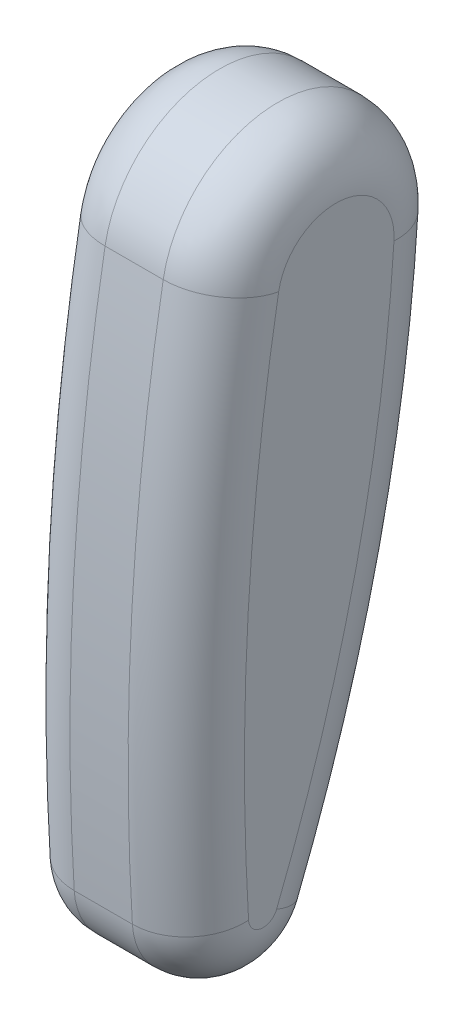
from build123d import *

# Parameters (mm, degrees)
BASE_EXTRUDE_DEPTH = 76.2
FILLET1_R          = 50.8


with BuildPart() as part:
    # Sketch6 → Base-Extrude (new, symmetric)
    with BuildSketch(Plane(origin=(114.3, 0, 0), x_dir=(0, 0, -1), z_dir=(1, 0, 0))):
        with BuildLine():
            ThreePointArc((140.863322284, -309.38746157), (51.487534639, -202.075387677), (-60.600919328, -285.382596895))
            ThreePointArc((-60.600919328, -285.382596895), (-87.974645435, -521.672761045), (-87.547578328, -759.542851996))
            ThreePointArc((-87.547578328, -759.542851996), (-34.291316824, -818.399413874), (34.789931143, -779.308424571))
            ThreePointArc((34.789931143, -779.308424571), (106.512103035, -548.56574137), (140.863322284, -309.38746157))
        make_face()
    extrude(amount=BASE_EXTRUDE_DEPTH, both=True)

    # Fillet1
    fillet1_edges = [part.edges().sort_by_distance(p)[0] for p in [
        (190.5, -548.56574137, -106.512103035),
        (190.5, -202.075387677, -51.487534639),
        (190.5, -521.672761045, 87.974645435),
        (38.1, -202.075387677, -51.487534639),
        (38.1, -548.56574137, -106.512103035),
        (38.1, -818.399413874, 34.291316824),
        (38.1, -521.672761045, 87.974645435),
        (190.5, -818.399413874, 34.291316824),
    ]]
    fillet(fillet1_edges, radius=FILLET1_R)


solid = part.part
